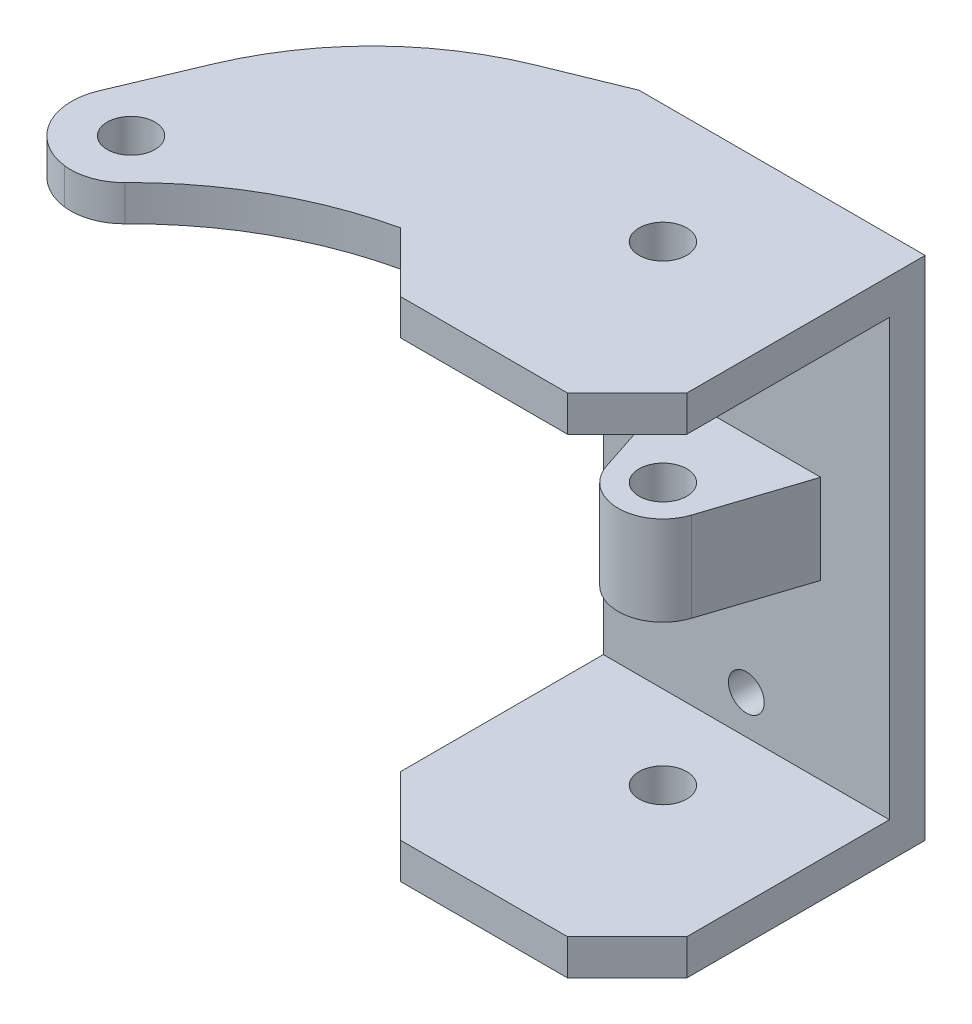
ISO-10303-21;
HEADER;
FILE_DESCRIPTION(('STEP AP214'),'2;1');
FILE_NAME('part.step','',(''),(''),'','','');
FILE_SCHEMA(('AUTOMOTIVE_DESIGN { 1 0 10303 214 1 1 1 1 }'));
ENDSEC;
DATA;
#1=APPLICATION_CONTEXT('core data for automotive mechanical design processes');
#2=APPLICATION_PROTOCOL_DEFINITION('international standard','automotive_design',2000,#1);
#3=PRODUCT_CONTEXT('',#1,'mechanical');
#4=PRODUCT('Part','Part','',(#3));
#5=PRODUCT_RELATED_PRODUCT_CATEGORY('part','',(#4));
#6=PRODUCT_DEFINITION_FORMATION('','',#4);
#7=PRODUCT_DEFINITION_CONTEXT('part definition',#1,'design');
#8=PRODUCT_DEFINITION('design','',#6,#7);
#9=PRODUCT_DEFINITION_SHAPE('','',#8);
#10=(LENGTH_UNIT() NAMED_UNIT(*) SI_UNIT(.MILLI.,.METRE.));
#11=(NAMED_UNIT(*) PLANE_ANGLE_UNIT() SI_UNIT($,.RADIAN.));
#12=(NAMED_UNIT(*) SI_UNIT($,.STERADIAN.) SOLID_ANGLE_UNIT());
#13=UNCERTAINTY_MEASURE_WITH_UNIT(LENGTH_MEASURE(1.E-05),#10,'distance_accuracy_value','');
#14=(GEOMETRIC_REPRESENTATION_CONTEXT(3) GLOBAL_UNCERTAINTY_ASSIGNED_CONTEXT((#13)) GLOBAL_UNIT_ASSIGNED_CONTEXT((#10,
#11,#12)) REPRESENTATION_CONTEXT('',''));
#15=CARTESIAN_POINT('',(0.,0.,0.));
#16=DIRECTION('',(0.,0.,1.));
#17=DIRECTION('',(1.,0.,0.));
#18=AXIS2_PLACEMENT_3D('',#15,#16,#17);
#19=CARTESIAN_POINT('',(0.,0.,6.));
#20=DIRECTION('',(0.,0.,-1.));
#21=DIRECTION('',(-1.,0.,0.));
#22=AXIS2_PLACEMENT_3D('',#19,#20,#21);
#23=PLANE('',#22);
#24=DIRECTION('',(0.,-1.,0.));
#25=VECTOR('',#24,1.);
#26=CARTESIAN_POINT('',(-12.4651492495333,0.,6.));
#27=LINE('',#26,#25);
#28=CARTESIAN_POINT('',(-12.4651492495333,7.5,6.));
#29=VERTEX_POINT('',#28);
#30=CARTESIAN_POINT('',(-12.4651492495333,-7.5,6.));
#31=VERTEX_POINT('',#30);
#32=EDGE_CURVE('E310',#29,#31,#27,.T.);
#33=ORIENTED_EDGE('',*,*,#32,.F.);
#34=DIRECTION('',(1.,0.,0.));
#35=VECTOR('',#34,1.);
#36=CARTESIAN_POINT('',(0.,7.5,6.));
#37=LINE('',#36,#35);
#38=CARTESIAN_POINT('',(12.4651492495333,7.5,6.));
#39=VERTEX_POINT('',#38);
#40=EDGE_CURVE('E306',#29,#39,#37,.T.);
#41=ORIENTED_EDGE('',*,*,#40,.T.);
#42=DIRECTION('',(0.,-1.,0.));
#43=VECTOR('',#42,1.);
#44=CARTESIAN_POINT('',(12.4651492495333,0.,6.));
#45=LINE('',#44,#43);
#46=CARTESIAN_POINT('',(12.4651492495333,-7.5,6.));
#47=VERTEX_POINT('',#46);
#48=EDGE_CURVE('E308',#39,#47,#45,.T.);
#49=ORIENTED_EDGE('',*,*,#48,.T.);
#50=DIRECTION('',(1.,0.,0.));
#51=VECTOR('',#50,1.);
#52=CARTESIAN_POINT('',(0.,-7.5,6.));
#53=LINE('',#52,#51);
#54=EDGE_CURVE('E303',#31,#47,#53,.T.);
#55=ORIENTED_EDGE('',*,*,#54,.F.);
#56=EDGE_LOOP('',(#33,#41,#49,#55));
#57=FACE_BOUND('',#56,.T.);
#58=CARTESIAN_POINT('',(0.,30.,6.));
#59=DIRECTION('',(0.,0.,1.));
#60=DIRECTION('',(1.,0.,0.));
#61=AXIS2_PLACEMENT_3D('',#58,#59,#60);
#62=CIRCLE('',#61,3.);
#63=CARTESIAN_POINT('',(3.,30.,6.));
#64=VERTEX_POINT('',#63);
#65=EDGE_CURVE('E340',#64,#64,#62,.T.);
#66=ORIENTED_EDGE('',*,*,#65,.F.);
#67=EDGE_LOOP('',(#66));
#68=FACE_BOUND('',#67,.T.);
#69=CARTESIAN_POINT('',(0.,-30.,6.));
#70=DIRECTION('',(0.,0.,1.));
#71=DIRECTION('',(1.,0.,0.));
#72=AXIS2_PLACEMENT_3D('',#69,#70,#71);
#73=CIRCLE('',#72,3.);
#74=CARTESIAN_POINT('',(3.,-30.,6.));
#75=VERTEX_POINT('',#74);
#76=EDGE_CURVE('E335',#75,#75,#73,.T.);
#77=ORIENTED_EDGE('',*,*,#76,.F.);
#78=EDGE_LOOP('',(#77));
#79=FACE_BOUND('',#78,.T.);
#80=DIRECTION('',(-1.,0.,0.));
#81=VECTOR('',#80,1.);
#82=CARTESIAN_POINT('',(-24.,-36.5,6.));
#83=LINE('',#82,#81);
#84=CARTESIAN_POINT('',(24.,-36.5,6.));
#85=VERTEX_POINT('',#84);
#86=CARTESIAN_POINT('',(-24.,-36.5,6.));
#87=VERTEX_POINT('',#86);
#88=EDGE_CURVE('E313',#85,#87,#83,.T.);
#89=ORIENTED_EDGE('',*,*,#88,.F.);
#90=DIRECTION('',(0.,1.,0.));
#91=VECTOR('',#90,1.);
#92=CARTESIAN_POINT('',(24.,42.5,6.));
#93=LINE('',#92,#91);
#94=CARTESIAN_POINT('',(24.,36.5,6.));
#95=VERTEX_POINT('',#94);
#96=EDGE_CURVE('E351',#85,#95,#93,.T.);
#97=ORIENTED_EDGE('',*,*,#96,.T.);
#98=DIRECTION('',(1.,0.,0.));
#99=VECTOR('',#98,1.);
#100=CARTESIAN_POINT('',(-24.,36.5,6.));
#101=LINE('',#100,#99);
#102=CARTESIAN_POINT('',(-24.,36.5,6.));
#103=VERTEX_POINT('',#102);
#104=EDGE_CURVE('E326',#103,#95,#101,.T.);
#105=ORIENTED_EDGE('',*,*,#104,.F.);
#106=DIRECTION('',(0.,-1.,0.));
#107=VECTOR('',#106,1.);
#108=CARTESIAN_POINT('',(-24.,-42.5,6.));
#109=LINE('',#108,#107);
#110=EDGE_CURVE('E348',#103,#87,#109,.T.);
#111=ORIENTED_EDGE('',*,*,#110,.T.);
#112=EDGE_LOOP('',(#89,#97,#105,#111));
#113=FACE_BOUND('',#112,.T.);
#114=ADVANCED_FACE('F40',(#57,#68,#79,#113),#23,.F.);
#115=CARTESIAN_POINT('',(-24.,-42.5,6.));
#116=DIRECTION('',(1.,0.,0.));
#117=DIRECTION('',(0.,0.,-1.));
#118=AXIS2_PLACEMENT_3D('',#115,#116,#117);
#119=PLANE('',#118);
#120=ORIENTED_EDGE('',*,*,#110,.F.);
#121=DIRECTION('',(0.,0.,-1.));
#122=VECTOR('',#121,1.);
#123=CARTESIAN_POINT('',(-24.,36.5,40.));
#124=LINE('',#123,#122);
#125=CARTESIAN_POINT('',(-24.,36.5,0.));
#126=VERTEX_POINT('',#125);
#127=EDGE_CURVE('E231',#103,#126,#124,.T.);
#128=ORIENTED_EDGE('',*,*,#127,.T.);
#129=DIRECTION('',(0.,-1.,0.));
#130=VECTOR('',#129,1.);
#131=CARTESIAN_POINT('',(-24.,-42.5,0.));
#132=LINE('',#131,#130);
#133=CARTESIAN_POINT('',(-24.,-42.5,0.));
#134=VERTEX_POINT('',#133);
#135=EDGE_CURVE('E339',#126,#134,#132,.T.);
#136=ORIENTED_EDGE('',*,*,#135,.T.);
#137=DIRECTION('',(0.,0.,-1.));
#138=VECTOR('',#137,1.);
#139=CARTESIAN_POINT('',(-24.,-42.5,6.));
#140=LINE('',#139,#138);
#141=CARTESIAN_POINT('',(-24.,-42.5,40.));
#142=VERTEX_POINT('',#141);
#143=EDGE_CURVE('E370',#142,#134,#140,.T.);
#144=ORIENTED_EDGE('',*,*,#143,.F.);
#145=DIRECTION('',(0.,1.,0.));
#146=VECTOR('',#145,1.);
#147=CARTESIAN_POINT('',(-24.,-42.5,40.));
#148=LINE('',#147,#146);
#149=CARTESIAN_POINT('',(-24.,-36.5,40.));
#150=VERTEX_POINT('',#149);
#151=EDGE_CURVE('E202',#142,#150,#148,.T.);
#152=ORIENTED_EDGE('',*,*,#151,.T.);
#153=DIRECTION('',(0.,0.,-1.));
#154=VECTOR('',#153,1.);
#155=CARTESIAN_POINT('',(-24.,-36.5,50.));
#156=LINE('',#155,#154);
#157=EDGE_CURVE('E320',#150,#87,#156,.T.);
#158=ORIENTED_EDGE('',*,*,#157,.T.);
#159=EDGE_LOOP('',(#120,#128,#136,#144,#152,#158));
#160=FACE_BOUND('',#159,.T.);
#161=ADVANCED_FACE('F437',(#160),#119,.F.);
#162=CARTESIAN_POINT('',(-24.,-42.5,6.));
#163=DIRECTION('',(0.,1.,0.));
#164=DIRECTION('',(-1.,0.,0.));
#165=AXIS2_PLACEMENT_3D('',#162,#163,#164);
#166=PLANE('',#165);
#167=CARTESIAN_POINT('',(0.,-42.5,20.));
#168=DIRECTION('',(0.,1.,0.));
#169=DIRECTION('',(-1.,0.,0.));
#170=AXIS2_PLACEMENT_3D('',#167,#168,#169);
#171=CIRCLE('',#170,4.00000000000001);
#172=CARTESIAN_POINT('',(-4.00000000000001,-42.5,20.));
#173=VERTEX_POINT('',#172);
#174=EDGE_CURVE('E268',#173,#173,#171,.T.);
#175=ORIENTED_EDGE('',*,*,#174,.T.);
#176=EDGE_LOOP('',(#175));
#177=FACE_BOUND('',#176,.T.);
#178=DIRECTION('',(1.,0.,0.));
#179=VECTOR('',#178,1.);
#180=CARTESIAN_POINT('',(-24.,-42.5,50.));
#181=LINE('',#180,#179);
#182=CARTESIAN_POINT('',(-14.,-42.5,50.));
#183=VERTEX_POINT('',#182);
#184=CARTESIAN_POINT('',(14.,-42.5,50.));
#185=VERTEX_POINT('',#184);
#186=EDGE_CURVE('E314',#183,#185,#181,.T.);
#187=ORIENTED_EDGE('',*,*,#186,.F.);
#188=DIRECTION('',(0.707106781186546,0.,0.707106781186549));
#189=VECTOR('',#188,1.);
#190=CARTESIAN_POINT('',(-14.,-42.5,50.));
#191=LINE('',#190,#189);
#192=EDGE_CURVE('E225',#183,#142,#191,.F.);
#193=ORIENTED_EDGE('',*,*,#192,.T.);
#194=ORIENTED_EDGE('',*,*,#143,.T.);
#195=DIRECTION('',(1.,0.,0.));
#196=VECTOR('',#195,1.);
#197=CARTESIAN_POINT('',(-24.,-42.5,0.));
#198=LINE('',#197,#196);
#199=CARTESIAN_POINT('',(24.,-42.5,0.));
#200=VERTEX_POINT('',#199);
#201=EDGE_CURVE('E359',#134,#200,#198,.T.);
#202=ORIENTED_EDGE('',*,*,#201,.T.);
#203=DIRECTION('',(0.,0.,-1.));
#204=VECTOR('',#203,1.);
#205=CARTESIAN_POINT('',(24.,-42.5,6.));
#206=LINE('',#205,#204);
#207=CARTESIAN_POINT('',(24.,-42.5,39.9999999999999));
#208=VERTEX_POINT('',#207);
#209=EDGE_CURVE('E368',#208,#200,#206,.T.);
#210=ORIENTED_EDGE('',*,*,#209,.F.);
#211=DIRECTION('',(0.707106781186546,0.,-0.707106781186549));
#212=VECTOR('',#211,1.);
#213=CARTESIAN_POINT('',(14.,-42.5,50.));
#214=LINE('',#213,#212);
#215=EDGE_CURVE('E223',#208,#185,#214,.F.);
#216=ORIENTED_EDGE('',*,*,#215,.T.);
#217=EDGE_LOOP('',(#187,#193,#194,#202,#210,#216));
#218=FACE_BOUND('',#217,.T.);
#219=ADVANCED_FACE('F434',(#177,#218),#166,.F.);
#220=CARTESIAN_POINT('',(24.,42.5,6.));
#221=DIRECTION('',(-1.,0.,0.));
#222=DIRECTION('',(0.,-1.,0.));
#223=AXIS2_PLACEMENT_3D('',#220,#221,#222);
#224=PLANE('',#223);
#225=DIRECTION('',(0.,0.,-1.));
#226=VECTOR('',#225,1.);
#227=CARTESIAN_POINT('',(24.,42.5,6.));
#228=LINE('',#227,#226);
#229=CARTESIAN_POINT('',(24.,42.5,40.));
#230=VERTEX_POINT('',#229);
#231=CARTESIAN_POINT('',(24.,42.5,0.));
#232=VERTEX_POINT('',#231);
#233=EDGE_CURVE('E355',#230,#232,#228,.T.);
#234=ORIENTED_EDGE('',*,*,#233,.F.);
#235=DIRECTION('',(0.,-1.,0.));
#236=VECTOR('',#235,1.);
#237=CARTESIAN_POINT('',(24.,36.5,40.));
#238=LINE('',#237,#236);
#239=CARTESIAN_POINT('',(24.,36.5,40.));
#240=VERTEX_POINT('',#239);
#241=EDGE_CURVE('E215',#230,#240,#238,.T.);
#242=ORIENTED_EDGE('',*,*,#241,.T.);
#243=DIRECTION('',(0.,0.,-1.));
#244=VECTOR('',#243,1.);
#245=CARTESIAN_POINT('',(24.,36.5,50.));
#246=LINE('',#245,#244);
#247=EDGE_CURVE('E331',#240,#95,#246,.T.);
#248=ORIENTED_EDGE('',*,*,#247,.T.);
#249=ORIENTED_EDGE('',*,*,#96,.F.);
#250=DIRECTION('',(0.,0.,-1.));
#251=VECTOR('',#250,1.);
#252=CARTESIAN_POINT('',(24.,-36.5,50.));
#253=LINE('',#252,#251);
#254=CARTESIAN_POINT('',(24.,-36.5,39.9999999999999));
#255=VERTEX_POINT('',#254);
#256=EDGE_CURVE('E324',#255,#85,#253,.T.);
#257=ORIENTED_EDGE('',*,*,#256,.F.);
#258=DIRECTION('',(0.,-1.,0.));
#259=VECTOR('',#258,1.);
#260=CARTESIAN_POINT('',(24.,42.5,39.9999999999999));
#261=LINE('',#260,#259);
#262=EDGE_CURVE('E213',#255,#208,#261,.T.);
#263=ORIENTED_EDGE('',*,*,#262,.T.);
#264=ORIENTED_EDGE('',*,*,#209,.T.);
#265=DIRECTION('',(0.,1.,0.));
#266=VECTOR('',#265,1.);
#267=CARTESIAN_POINT('',(24.,42.5,0.));
#268=LINE('',#267,#266);
#269=EDGE_CURVE('E362',#200,#232,#268,.T.);
#270=ORIENTED_EDGE('',*,*,#269,.T.);
#271=EDGE_LOOP('',(#234,#242,#248,#249,#257,#263,#264,#270));
#272=FACE_BOUND('',#271,.T.);
#273=ADVANCED_FACE('F389',(#272),#224,.F.);
#274=CARTESIAN_POINT('',(-24.,42.5,6.));
#275=DIRECTION('',(0.,-1.,0.));
#276=DIRECTION('',(0.,0.,-1.));
#277=AXIS2_PLACEMENT_3D('',#274,#275,#276);
#278=PLANE('',#277);
#279=CARTESIAN_POINT('',(0.,42.5,20.));
#280=DIRECTION('',(0.,-1.,0.));
#281=DIRECTION('',(0.,0.,-1.));
#282=AXIS2_PLACEMENT_3D('',#279,#280,#281);
#283=CIRCLE('',#282,4.00000000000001);
#284=CARTESIAN_POINT('',(0.,42.5,16.));
#285=VERTEX_POINT('',#284);
#286=EDGE_CURVE('E280',#285,#285,#283,.T.);
#287=ORIENTED_EDGE('',*,*,#286,.T.);
#288=EDGE_LOOP('',(#287));
#289=FACE_BOUND('',#288,.T.);
#290=CARTESIAN_POINT('',(-60.0021570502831,42.5,49.2388496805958));
#291=DIRECTION('',(0.,1.,0.));
#292=DIRECTION('',(0.,0.,-1.));
#293=AXIS2_PLACEMENT_3D('',#290,#291,#292);
#294=CIRCLE('',#293,10.);
#295=CARTESIAN_POINT('',(-69.2176551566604,42.5,45.356248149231));
#296=VERTEX_POINT('',#295);
#297=CARTESIAN_POINT('',(-61.2698092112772,42.5,59.1581771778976));
#298=VERTEX_POINT('',#297);
#299=EDGE_CURVE('E191',#296,#298,#294,.T.);
#300=ORIENTED_EDGE('',*,*,#299,.T.);
#301=CARTESIAN_POINT('',(-60.1289222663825,42.5,50.230782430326));
#302=DIRECTION('',(0.,-1.,0.));
#303=DIRECTION('',(0.,0.,-1.));
#304=AXIS2_PLACEMENT_3D('',#301,#302,#303);
#305=CIRCLE('',#304,9.);
#306=CARTESIAN_POINT('',(-53.7034653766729,42.5,56.5326475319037));
#307=VERTEX_POINT('',#306);
#308=EDGE_CURVE('E62',#298,#307,#305,.F.);
#309=ORIENTED_EDGE('',*,*,#308,.T.);
#310=CARTESIAN_POINT('',(-10.8670861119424,42.5,98.5450815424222));
#311=DIRECTION('',(0.,-1.,0.));
#312=DIRECTION('',(0.,0.,1.));
#313=AXIS2_PLACEMENT_3D('',#310,#311,#312);
#314=CIRCLE('',#313,60.);
#315=CARTESIAN_POINT('',(-24.,42.5,40.));
#316=VERTEX_POINT('',#315);
#317=EDGE_CURVE('E400',#307,#316,#314,.T.);
#318=ORIENTED_EDGE('',*,*,#317,.T.);
#319=DIRECTION('',(0.707106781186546,0.,0.707106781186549));
#320=VECTOR('',#319,1.);
#321=CARTESIAN_POINT('',(-14.,42.5,50.));
#322=LINE('',#321,#320);
#323=CARTESIAN_POINT('',(-14.,42.5,50.));
#324=VERTEX_POINT('',#323);
#325=EDGE_CURVE('E206',#316,#324,#322,.T.);
#326=ORIENTED_EDGE('',*,*,#325,.T.);
#327=DIRECTION('',(-1.,0.,0.));
#328=VECTOR('',#327,1.);
#329=CARTESIAN_POINT('',(-24.,42.5,50.));
#330=LINE('',#329,#328);
#331=CARTESIAN_POINT('',(14.,42.5,50.));
#332=VERTEX_POINT('',#331);
#333=EDGE_CURVE('E328',#332,#324,#330,.T.);
#334=ORIENTED_EDGE('',*,*,#333,.F.);
#335=DIRECTION('',(0.707106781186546,0.,-0.707106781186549));
#336=VECTOR('',#335,1.);
#337=CARTESIAN_POINT('',(14.,42.5,50.));
#338=LINE('',#337,#336);
#339=EDGE_CURVE('E207',#332,#230,#338,.T.);
#340=ORIENTED_EDGE('',*,*,#339,.T.);
#341=ORIENTED_EDGE('',*,*,#233,.T.);
#342=DIRECTION('',(-1.,0.,0.));
#343=VECTOR('',#342,1.);
#344=CARTESIAN_POINT('',(-24.,42.5,0.));
#345=LINE('',#344,#343);
#346=CARTESIAN_POINT('',(-24.,42.5,0.));
#347=VERTEX_POINT('',#346);
#348=EDGE_CURVE('E352',#232,#347,#345,.T.);
#349=ORIENTED_EDGE('',*,*,#348,.T.);
#350=DIRECTION('',(-0.926175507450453,0.,0.37709273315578));
#351=VECTOR('',#350,1.);
#352=CARTESIAN_POINT('',(-24.,42.5,0.));
#353=LINE('',#352,#351);
#354=CARTESIAN_POINT('',(-36.3326948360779,42.5,5.02126169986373));
#355=VERTEX_POINT('',#354);
#356=EDGE_CURVE('E259',#347,#355,#353,.T.);
#357=ORIENTED_EDGE('',*,*,#356,.T.);
#358=CARTESIAN_POINT('',(-17.4780581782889,42.5,51.3300370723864));
#359=DIRECTION('',(0.,-1.,0.));
#360=DIRECTION('',(0.,0.,-1.));
#361=AXIS2_PLACEMENT_3D('',#358,#359,#360);
#362=CIRCLE('',#361,50.);
#363=CARTESIAN_POINT('',(-63.5555487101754,42.5,31.9170294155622));
#364=VERTEX_POINT('',#363);
#365=EDGE_CURVE('E235',#355,#364,#362,.F.);
#366=ORIENTED_EDGE('',*,*,#365,.T.);
#367=DIRECTION('',(-0.388260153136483,0.,0.921549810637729));
#368=VECTOR('',#367,1.);
#369=CARTESIAN_POINT('',(-55.5144176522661,42.5,12.8311079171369));
#370=LINE('',#369,#368);
#371=EDGE_CURVE('E256',#364,#296,#370,.T.);
#372=ORIENTED_EDGE('',*,*,#371,.T.);
#373=EDGE_LOOP('',(#300,#309,#318,#326,#334,#340,#341,#349,#357,#366,#372));
#374=FACE_BOUND('',#373,.T.);
#375=CARTESIAN_POINT('',(-60.0021570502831,42.5,49.2388496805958));
#376=DIRECTION('',(0.,1.,0.));
#377=DIRECTION('',(0.,0.,1.));
#378=AXIS2_PLACEMENT_3D('',#375,#376,#377);
#379=CIRCLE('',#378,4.);
#380=CARTESIAN_POINT('',(-60.0021570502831,42.5,53.2388496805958));
#381=VERTEX_POINT('',#380);
#382=EDGE_CURVE('E411',#381,#381,#379,.T.);
#383=ORIENTED_EDGE('',*,*,#382,.F.);
#384=EDGE_LOOP('',(#383));
#385=FACE_BOUND('',#384,.T.);
#386=ADVANCED_FACE('F253',(#289,#374,#385),#278,.F.);
#387=CARTESIAN_POINT('',(0.,0.,0.));
#388=DIRECTION('',(0.,0.,-1.));
#389=DIRECTION('',(-1.,0.,0.));
#390=AXIS2_PLACEMENT_3D('',#387,#388,#389);
#391=PLANE('',#390);
#392=CARTESIAN_POINT('',(0.,30.,0.));
#393=DIRECTION('',(0.,0.,1.));
#394=DIRECTION('',(1.,0.,0.));
#395=AXIS2_PLACEMENT_3D('',#392,#393,#394);
#396=CIRCLE('',#395,3.);
#397=CARTESIAN_POINT('',(3.,30.,0.));
#398=VERTEX_POINT('',#397);
#399=EDGE_CURVE('E336',#398,#398,#396,.T.);
#400=ORIENTED_EDGE('',*,*,#399,.T.);
#401=EDGE_LOOP('',(#400));
#402=FACE_BOUND('',#401,.T.);
#403=CARTESIAN_POINT('',(0.,-30.,0.));
#404=DIRECTION('',(0.,0.,1.));
#405=DIRECTION('',(1.,0.,0.));
#406=AXIS2_PLACEMENT_3D('',#403,#404,#405);
#407=CIRCLE('',#406,3.);
#408=CARTESIAN_POINT('',(3.,-30.,0.));
#409=VERTEX_POINT('',#408);
#410=EDGE_CURVE('E343',#409,#409,#407,.T.);
#411=ORIENTED_EDGE('',*,*,#410,.T.);
#412=EDGE_LOOP('',(#411));
#413=FACE_BOUND('',#412,.T.);
#414=EDGE_CURVE('E356',#347,#126,#132,.T.);
#415=ORIENTED_EDGE('',*,*,#414,.F.);
#416=ORIENTED_EDGE('',*,*,#348,.F.);
#417=ORIENTED_EDGE('',*,*,#269,.F.);
#418=ORIENTED_EDGE('',*,*,#201,.F.);
#419=ORIENTED_EDGE('',*,*,#135,.F.);
#420=EDGE_LOOP('',(#415,#416,#417,#418,#419));
#421=FACE_BOUND('',#420,.T.);
#422=ADVANCED_FACE('F396',(#402,#413,#421),#391,.T.);
#423=CARTESIAN_POINT('',(0.,-30.,0.));
#424=DIRECTION('',(0.,0.,1.));
#425=DIRECTION('',(1.,0.,0.));
#426=AXIS2_PLACEMENT_3D('',#423,#424,#425);
#427=CYLINDRICAL_SURFACE('',#426,3.);
#428=ORIENTED_EDGE('',*,*,#410,.F.);
#429=EDGE_LOOP('',(#428));
#430=FACE_BOUND('',#429,.T.);
#431=ORIENTED_EDGE('',*,*,#76,.T.);
#432=EDGE_LOOP('',(#431));
#433=FACE_BOUND('',#432,.T.);
#434=ADVANCED_FACE('F431',(#430,#433),#427,.F.);
#435=CARTESIAN_POINT('',(0.,30.,0.));
#436=DIRECTION('',(0.,0.,1.));
#437=DIRECTION('',(1.,0.,0.));
#438=AXIS2_PLACEMENT_3D('',#435,#436,#437);
#439=CYLINDRICAL_SURFACE('',#438,3.);
#440=ORIENTED_EDGE('',*,*,#399,.F.);
#441=EDGE_LOOP('',(#440));
#442=FACE_BOUND('',#441,.T.);
#443=ORIENTED_EDGE('',*,*,#65,.T.);
#444=EDGE_LOOP('',(#443));
#445=FACE_BOUND('',#444,.T.);
#446=ADVANCED_FACE('F449',(#442,#445),#439,.F.);
#447=CARTESIAN_POINT('',(-24.,36.5,50.));
#448=DIRECTION('',(0.,1.,0.));
#449=DIRECTION('',(0.,0.,1.));
#450=AXIS2_PLACEMENT_3D('',#447,#448,#449);
#451=PLANE('',#450);
#452=CARTESIAN_POINT('',(0.,36.5,20.));
#453=DIRECTION('',(0.,1.,0.));
#454=DIRECTION('',(0.,0.,1.));
#455=AXIS2_PLACEMENT_3D('',#452,#453,#454);
#456=CIRCLE('',#455,4.00000000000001);
#457=CARTESIAN_POINT('',(0.,36.5,24.));
#458=VERTEX_POINT('',#457);
#459=EDGE_CURVE('E277',#458,#458,#456,.T.);
#460=ORIENTED_EDGE('',*,*,#459,.T.);
#461=EDGE_LOOP('',(#460));
#462=FACE_BOUND('',#461,.T.);
#463=CARTESIAN_POINT('',(-10.8670861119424,36.5,98.5450815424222));
#464=DIRECTION('',(0.,-1.,0.));
#465=DIRECTION('',(0.,0.,1.));
#466=AXIS2_PLACEMENT_3D('',#463,#464,#465);
#467=CIRCLE('',#466,60.);
#468=CARTESIAN_POINT('',(-53.7034653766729,36.5,56.5326475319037));
#469=VERTEX_POINT('',#468);
#470=CARTESIAN_POINT('',(-24.,36.5,40.));
#471=VERTEX_POINT('',#470);
#472=EDGE_CURVE('E182',#469,#471,#467,.T.);
#473=ORIENTED_EDGE('',*,*,#472,.F.);
#474=CARTESIAN_POINT('',(-60.1289222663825,36.5,50.230782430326));
#475=DIRECTION('',(0.,1.,0.));
#476=DIRECTION('',(0.,0.,1.));
#477=AXIS2_PLACEMENT_3D('',#474,#475,#476);
#478=CIRCLE('',#477,9.);
#479=CARTESIAN_POINT('',(-61.2698092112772,36.5,59.1581771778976));
#480=VERTEX_POINT('',#479);
#481=EDGE_CURVE('E11',#469,#480,#478,.F.);
#482=ORIENTED_EDGE('',*,*,#481,.T.);
#483=CARTESIAN_POINT('',(-60.0021570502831,36.5,49.2388496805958));
#484=DIRECTION('',(0.,1.,0.));
#485=DIRECTION('',(0.,0.,-1.));
#486=AXIS2_PLACEMENT_3D('',#483,#484,#485);
#487=CIRCLE('',#486,10.);
#488=CARTESIAN_POINT('',(-69.2176551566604,36.5,45.356248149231));
#489=VERTEX_POINT('',#488);
#490=EDGE_CURVE('E251',#489,#480,#487,.T.);
#491=ORIENTED_EDGE('',*,*,#490,.F.);
#492=DIRECTION('',(-0.388260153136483,0.,0.921549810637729));
#493=VECTOR('',#492,1.);
#494=CARTESIAN_POINT('',(-55.5144176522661,36.5,12.8311079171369));
#495=LINE('',#494,#493);
#496=CARTESIAN_POINT('',(-63.5555487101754,36.5,31.9170294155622));
#497=VERTEX_POINT('',#496);
#498=EDGE_CURVE('E405',#497,#489,#495,.T.);
#499=ORIENTED_EDGE('',*,*,#498,.F.);
#500=CARTESIAN_POINT('',(-17.4780581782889,36.5,51.3300370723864));
#501=DIRECTION('',(0.,1.,0.));
#502=DIRECTION('',(0.,0.,1.));
#503=AXIS2_PLACEMENT_3D('',#500,#501,#502);
#504=CIRCLE('',#503,50.);
#505=CARTESIAN_POINT('',(-36.3326948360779,36.5,5.02126169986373));
#506=VERTEX_POINT('',#505);
#507=EDGE_CURVE('E239',#497,#506,#504,.F.);
#508=ORIENTED_EDGE('',*,*,#507,.T.);
#509=DIRECTION('',(-0.926175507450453,0.,0.37709273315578));
#510=VECTOR('',#509,1.);
#511=CARTESIAN_POINT('',(-24.,36.5,0.));
#512=LINE('',#511,#510);
#513=EDGE_CURVE('E190',#126,#506,#512,.T.);
#514=ORIENTED_EDGE('',*,*,#513,.F.);
#515=ORIENTED_EDGE('',*,*,#127,.F.);
#516=ORIENTED_EDGE('',*,*,#104,.T.);
#517=ORIENTED_EDGE('',*,*,#247,.F.);
#518=DIRECTION('',(-0.707106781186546,0.,0.707106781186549));
#519=VECTOR('',#518,1.);
#520=CARTESIAN_POINT('',(14.,36.5,50.));
#521=LINE('',#520,#519);
#522=CARTESIAN_POINT('',(14.,36.5,50.));
#523=VERTEX_POINT('',#522);
#524=EDGE_CURVE('E203',#240,#523,#521,.T.);
#525=ORIENTED_EDGE('',*,*,#524,.T.);
#526=DIRECTION('',(1.,0.,0.));
#527=VECTOR('',#526,1.);
#528=CARTESIAN_POINT('',(-24.,36.5,50.));
#529=LINE('',#528,#527);
#530=CARTESIAN_POINT('',(-14.,36.5,50.));
#531=VERTEX_POINT('',#530);
#532=EDGE_CURVE('E198',#531,#523,#529,.T.);
#533=ORIENTED_EDGE('',*,*,#532,.F.);
#534=DIRECTION('',(-0.707106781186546,0.,-0.707106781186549));
#535=VECTOR('',#534,1.);
#536=CARTESIAN_POINT('',(-14.,36.5,50.));
#537=LINE('',#536,#535);
#538=EDGE_CURVE('E194',#531,#471,#537,.T.);
#539=ORIENTED_EDGE('',*,*,#538,.T.);
#540=EDGE_LOOP('',(#473,#482,#491,#499,#508,#514,#515,#516,#517,#525,#533,#539));
#541=FACE_BOUND('',#540,.T.);
#542=CARTESIAN_POINT('',(-60.0021570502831,36.5,49.2388496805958));
#543=DIRECTION('',(0.,1.,0.));
#544=DIRECTION('',(0.,0.,1.));
#545=AXIS2_PLACEMENT_3D('',#542,#543,#544);
#546=CIRCLE('',#545,4.);
#547=CARTESIAN_POINT('',(-60.0021570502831,36.5,53.2388496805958));
#548=VERTEX_POINT('',#547);
#549=EDGE_CURVE('E401',#548,#548,#546,.T.);
#550=ORIENTED_EDGE('',*,*,#549,.T.);
#551=EDGE_LOOP('',(#550));
#552=FACE_BOUND('',#551,.T.);
#553=ADVANCED_FACE('F195',(#462,#541,#552),#451,.F.);
#554=CARTESIAN_POINT('',(0.,0.,50.));
#555=DIRECTION('',(0.,0.,1.));
#556=DIRECTION('',(1.,0.,0.));
#557=AXIS2_PLACEMENT_3D('',#554,#555,#556);
#558=PLANE('',#557);
#559=ORIENTED_EDGE('',*,*,#333,.T.);
#560=DIRECTION('',(0.,-1.,0.));
#561=VECTOR('',#560,1.);
#562=CARTESIAN_POINT('',(-14.,36.5,50.));
#563=LINE('',#562,#561);
#564=EDGE_CURVE('E376',#324,#531,#563,.T.);
#565=ORIENTED_EDGE('',*,*,#564,.T.);
#566=ORIENTED_EDGE('',*,*,#532,.T.);
#567=DIRECTION('',(0.,1.,0.));
#568=VECTOR('',#567,1.);
#569=CARTESIAN_POINT('',(14.,42.5,50.));
#570=LINE('',#569,#568);
#571=EDGE_CURVE('E373',#523,#332,#570,.T.);
#572=ORIENTED_EDGE('',*,*,#571,.T.);
#573=EDGE_LOOP('',(#559,#565,#566,#572));
#574=FACE_BOUND('',#573,.T.);
#575=ADVANCED_FACE('F384',(#574),#558,.T.);
#576=CARTESIAN_POINT('',(-24.,-36.5,50.));
#577=DIRECTION('',(0.,-1.,0.));
#578=DIRECTION('',(0.,0.,-1.));
#579=AXIS2_PLACEMENT_3D('',#576,#577,#578);
#580=PLANE('',#579);
#581=CARTESIAN_POINT('',(0.,-36.5,20.));
#582=DIRECTION('',(0.,-1.,0.));
#583=DIRECTION('',(0.,0.,-1.));
#584=AXIS2_PLACEMENT_3D('',#581,#582,#583);
#585=CIRCLE('',#584,4.00000000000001);
#586=CARTESIAN_POINT('',(0.,-36.5,16.));
#587=VERTEX_POINT('',#586);
#588=EDGE_CURVE('E265',#587,#587,#585,.T.);
#589=ORIENTED_EDGE('',*,*,#588,.T.);
#590=EDGE_LOOP('',(#589));
#591=FACE_BOUND('',#590,.T.);
#592=ORIENTED_EDGE('',*,*,#157,.F.);
#593=DIRECTION('',(-0.707106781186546,0.,-0.707106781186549));
#594=VECTOR('',#593,1.);
#595=CARTESIAN_POINT('',(-14.,-36.5,50.));
#596=LINE('',#595,#594);
#597=CARTESIAN_POINT('',(-14.,-36.5,50.));
#598=VERTEX_POINT('',#597);
#599=EDGE_CURVE('E229',#150,#598,#596,.F.);
#600=ORIENTED_EDGE('',*,*,#599,.T.);
#601=DIRECTION('',(-1.,0.,0.));
#602=VECTOR('',#601,1.);
#603=CARTESIAN_POINT('',(-24.,-36.5,50.));
#604=LINE('',#603,#602);
#605=CARTESIAN_POINT('',(14.,-36.5,50.));
#606=VERTEX_POINT('',#605);
#607=EDGE_CURVE('E317',#606,#598,#604,.T.);
#608=ORIENTED_EDGE('',*,*,#607,.F.);
#609=DIRECTION('',(-0.707106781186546,0.,0.707106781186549));
#610=VECTOR('',#609,1.);
#611=CARTESIAN_POINT('',(14.,-36.5,50.));
#612=LINE('',#611,#610);
#613=EDGE_CURVE('E227',#606,#255,#612,.F.);
#614=ORIENTED_EDGE('',*,*,#613,.T.);
#615=ORIENTED_EDGE('',*,*,#256,.T.);
#616=ORIENTED_EDGE('',*,*,#88,.T.);
#617=EDGE_LOOP('',(#592,#600,#608,#614,#615,#616));
#618=FACE_BOUND('',#617,.T.);
#619=ADVANCED_FACE('F459',(#591,#618),#580,.F.);
#620=CARTESIAN_POINT('',(0.,0.,50.));
#621=DIRECTION('',(0.,0.,-1.));
#622=DIRECTION('',(-1.,0.,0.));
#623=AXIS2_PLACEMENT_3D('',#620,#621,#622);
#624=PLANE('',#623);
#625=ORIENTED_EDGE('',*,*,#607,.T.);
#626=DIRECTION('',(0.,-1.,0.));
#627=VECTOR('',#626,1.);
#628=CARTESIAN_POINT('',(-14.,0.,50.));
#629=LINE('',#628,#627);
#630=EDGE_CURVE('E220',#598,#183,#629,.T.);
#631=ORIENTED_EDGE('',*,*,#630,.T.);
#632=ORIENTED_EDGE('',*,*,#186,.T.);
#633=DIRECTION('',(0.,1.,0.));
#634=VECTOR('',#633,1.);
#635=CARTESIAN_POINT('',(14.,0.,50.));
#636=LINE('',#635,#634);
#637=EDGE_CURVE('E217',#185,#606,#636,.T.);
#638=ORIENTED_EDGE('',*,*,#637,.T.);
#639=EDGE_LOOP('',(#625,#631,#632,#638));
#640=FACE_BOUND('',#639,.T.);
#641=ADVANCED_FACE('F462',(#640),#624,.F.);
#642=CARTESIAN_POINT('',(-14.,0.,50.));
#643=DIRECTION('',(-0.707106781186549,0.,0.707106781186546));
#644=DIRECTION('',(0.,1.,0.));
#645=AXIS2_PLACEMENT_3D('',#642,#643,#644);
#646=PLANE('',#645);
#647=ORIENTED_EDGE('',*,*,#325,.F.);
#648=DIRECTION('',(0.,1.,0.));
#649=VECTOR('',#648,1.);
#650=CARTESIAN_POINT('',(-24.,42.5,40.));
#651=LINE('',#650,#649);
#652=EDGE_CURVE('E186',#471,#316,#651,.T.);
#653=ORIENTED_EDGE('',*,*,#652,.F.);
#654=ORIENTED_EDGE('',*,*,#538,.F.);
#655=ORIENTED_EDGE('',*,*,#564,.F.);
#656=EDGE_LOOP('',(#647,#653,#654,#655));
#657=FACE_BOUND('',#656,.T.);
#658=ADVANCED_FACE('F205',(#657),#646,.T.);
#659=CARTESIAN_POINT('',(14.,0.,50.));
#660=DIRECTION('',(0.707106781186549,0.,0.707106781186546));
#661=DIRECTION('',(0.,-1.,0.));
#662=AXIS2_PLACEMENT_3D('',#659,#660,#661);
#663=PLANE('',#662);
#664=ORIENTED_EDGE('',*,*,#524,.F.);
#665=ORIENTED_EDGE('',*,*,#241,.F.);
#666=ORIENTED_EDGE('',*,*,#339,.F.);
#667=ORIENTED_EDGE('',*,*,#571,.F.);
#668=EDGE_LOOP('',(#664,#665,#666,#667));
#669=FACE_BOUND('',#668,.T.);
#670=ADVANCED_FACE('F386',(#669),#663,.T.);
#671=CARTESIAN_POINT('',(-14.,0.,50.));
#672=DIRECTION('',(0.707106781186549,0.,-0.707106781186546));
#673=DIRECTION('',(0.,-1.,0.));
#674=AXIS2_PLACEMENT_3D('',#671,#672,#673);
#675=PLANE('',#674);
#676=ORIENTED_EDGE('',*,*,#599,.F.);
#677=ORIENTED_EDGE('',*,*,#151,.F.);
#678=ORIENTED_EDGE('',*,*,#192,.F.);
#679=ORIENTED_EDGE('',*,*,#630,.F.);
#680=EDGE_LOOP('',(#676,#677,#678,#679));
#681=FACE_BOUND('',#680,.T.);
#682=ADVANCED_FACE('F620',(#681),#675,.F.);
#683=CARTESIAN_POINT('',(14.,0.,50.));
#684=DIRECTION('',(-0.707106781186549,0.,-0.707106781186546));
#685=DIRECTION('',(0.,1.,0.));
#686=AXIS2_PLACEMENT_3D('',#683,#684,#685);
#687=PLANE('',#686);
#688=ORIENTED_EDGE('',*,*,#215,.F.);
#689=ORIENTED_EDGE('',*,*,#262,.F.);
#690=ORIENTED_EDGE('',*,*,#613,.F.);
#691=ORIENTED_EDGE('',*,*,#637,.F.);
#692=EDGE_LOOP('',(#688,#689,#690,#691));
#693=FACE_BOUND('',#692,.T.);
#694=ADVANCED_FACE('F471',(#693),#687,.F.);
#695=CARTESIAN_POINT('',(-13.0340005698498,7.5,4.25920275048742));
#696=DIRECTION('',(0.950536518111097,0.,-0.310612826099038));
#697=DIRECTION('',(-0.310612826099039,0.,-0.950536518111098));
#698=AXIS2_PLACEMENT_3D('',#695,#696,#697);
#699=PLANE('',#698);
#700=DIRECTION('',(0.310612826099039,0.,0.950536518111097));
#701=VECTOR('',#700,1.);
#702=CARTESIAN_POINT('',(-13.0340005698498,7.5,4.25920275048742));
#703=LINE('',#702,#701);
#704=CARTESIAN_POINT('',(-7.12902388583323,7.5,22.3295961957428));
#705=VERTEX_POINT('',#704);
#706=EDGE_CURVE('E284',#29,#705,#703,.T.);
#707=ORIENTED_EDGE('',*,*,#706,.F.);
#708=ORIENTED_EDGE('',*,*,#32,.T.);
#709=DIRECTION('',(0.310612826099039,0.,0.950536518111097));
#710=VECTOR('',#709,1.);
#711=CARTESIAN_POINT('',(-13.0340005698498,-7.5,4.25920275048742));
#712=LINE('',#711,#710);
#713=CARTESIAN_POINT('',(-7.12902388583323,-7.5,22.3295961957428));
#714=VERTEX_POINT('',#713);
#715=EDGE_CURVE('E283',#31,#714,#712,.T.);
#716=ORIENTED_EDGE('',*,*,#715,.T.);
#717=DIRECTION('',(0.,-1.,0.));
#718=VECTOR('',#717,1.);
#719=CARTESIAN_POINT('',(-7.12902388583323,7.5,22.3295961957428));
#720=LINE('',#719,#718);
#721=EDGE_CURVE('E300',#705,#714,#720,.T.);
#722=ORIENTED_EDGE('',*,*,#721,.F.);
#723=EDGE_LOOP('',(#707,#708,#716,#722));
#724=FACE_BOUND('',#723,.T.);
#725=ADVANCED_FACE('F467',(#724),#699,.F.);
#726=CARTESIAN_POINT('',(13.0340005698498,7.5,4.25920275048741));
#727=DIRECTION('',(0.950536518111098,0.,0.310612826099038));
#728=DIRECTION('',(0.310612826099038,0.,-0.950536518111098));
#729=AXIS2_PLACEMENT_3D('',#726,#727,#728);
#730=PLANE('',#729);
#731=ORIENTED_EDGE('',*,*,#48,.F.);
#732=DIRECTION('',(-0.310612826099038,0.,0.950536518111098));
#733=VECTOR('',#732,1.);
#734=CARTESIAN_POINT('',(13.0340005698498,7.5,4.25920275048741));
#735=LINE('',#734,#733);
#736=CARTESIAN_POINT('',(7.12902388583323,7.5,22.3295961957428));
#737=VERTEX_POINT('',#736);
#738=EDGE_CURVE('E290',#39,#737,#735,.T.);
#739=ORIENTED_EDGE('',*,*,#738,.T.);
#740=DIRECTION('',(0.,-1.,0.));
#741=VECTOR('',#740,1.);
#742=CARTESIAN_POINT('',(7.12902388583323,7.5,22.3295961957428));
#743=LINE('',#742,#741);
#744=CARTESIAN_POINT('',(7.12902388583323,-7.5,22.3295961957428));
#745=VERTEX_POINT('',#744);
#746=EDGE_CURVE('E292',#737,#745,#743,.T.);
#747=ORIENTED_EDGE('',*,*,#746,.T.);
#748=DIRECTION('',(-0.310612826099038,0.,0.950536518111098));
#749=VECTOR('',#748,1.);
#750=CARTESIAN_POINT('',(13.0340005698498,-7.5,4.25920275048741));
#751=LINE('',#750,#749);
#752=EDGE_CURVE('E287',#47,#745,#751,.T.);
#753=ORIENTED_EDGE('',*,*,#752,.F.);
#754=EDGE_LOOP('',(#731,#739,#747,#753));
#755=FACE_BOUND('',#754,.T.);
#756=ADVANCED_FACE('F470',(#755),#730,.T.);
#757=CARTESIAN_POINT('',(0.,7.5,0.));
#758=DIRECTION('',(0.,1.,0.));
#759=DIRECTION('',(0.,0.,1.));
#760=AXIS2_PLACEMENT_3D('',#757,#758,#759);
#761=PLANE('',#760);
#762=CARTESIAN_POINT('',(0.,7.5,20.));
#763=DIRECTION('',(0.,1.,0.));
#764=DIRECTION('',(0.,0.,1.));
#765=AXIS2_PLACEMENT_3D('',#762,#763,#764);
#766=CIRCLE('',#765,4.00000000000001);
#767=CARTESIAN_POINT('',(0.,7.5,24.));
#768=VERTEX_POINT('',#767);
#769=EDGE_CURVE('E274',#768,#768,#766,.T.);
#770=ORIENTED_EDGE('',*,*,#769,.F.);
#771=EDGE_LOOP('',(#770));
#772=FACE_BOUND('',#771,.T.);
#773=ORIENTED_EDGE('',*,*,#40,.F.);
#774=ORIENTED_EDGE('',*,*,#706,.T.);
#775=CARTESIAN_POINT('',(0.,7.5,20.));
#776=DIRECTION('',(0.,1.,0.));
#777=DIRECTION('',(0.,0.,1.));
#778=AXIS2_PLACEMENT_3D('',#775,#776,#777);
#779=CIRCLE('',#778,7.5);
#780=EDGE_CURVE('E286',#705,#737,#779,.T.);
#781=ORIENTED_EDGE('',*,*,#780,.T.);
#782=ORIENTED_EDGE('',*,*,#738,.F.);
#783=EDGE_LOOP('',(#773,#774,#781,#782));
#784=FACE_BOUND('',#783,.T.);
#785=ADVANCED_FACE('F481',(#772,#784),#761,.T.);
#786=CARTESIAN_POINT('',(0.,-7.5,0.));
#787=DIRECTION('',(0.,1.,0.));
#788=DIRECTION('',(0.,0.,1.));
#789=AXIS2_PLACEMENT_3D('',#786,#787,#788);
#790=PLANE('',#789);
#791=CARTESIAN_POINT('',(0.,-7.5,20.));
#792=DIRECTION('',(0.,-1.,0.));
#793=DIRECTION('',(0.,0.,-1.));
#794=AXIS2_PLACEMENT_3D('',#791,#792,#793);
#795=CIRCLE('',#794,4.00000000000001);
#796=CARTESIAN_POINT('',(0.,-7.5,16.));
#797=VERTEX_POINT('',#796);
#798=EDGE_CURVE('E271',#797,#797,#795,.T.);
#799=ORIENTED_EDGE('',*,*,#798,.F.);
#800=EDGE_LOOP('',(#799));
#801=FACE_BOUND('',#800,.T.);
#802=ORIENTED_EDGE('',*,*,#715,.F.);
#803=ORIENTED_EDGE('',*,*,#54,.T.);
#804=ORIENTED_EDGE('',*,*,#752,.T.);
#805=CARTESIAN_POINT('',(0.,-7.5,20.));
#806=DIRECTION('',(0.,1.,0.));
#807=DIRECTION('',(0.,0.,1.));
#808=AXIS2_PLACEMENT_3D('',#805,#806,#807);
#809=CIRCLE('',#808,7.5);
#810=EDGE_CURVE('E294',#714,#745,#809,.T.);
#811=ORIENTED_EDGE('',*,*,#810,.F.);
#812=EDGE_LOOP('',(#802,#803,#804,#811));
#813=FACE_BOUND('',#812,.T.);
#814=ADVANCED_FACE('F477',(#801,#813),#790,.F.);
#815=CARTESIAN_POINT('',(0.,7.5,20.));
#816=DIRECTION('',(0.,-1.,0.));
#817=DIRECTION('',(0.,0.,-1.));
#818=AXIS2_PLACEMENT_3D('',#815,#816,#817);
#819=CYLINDRICAL_SURFACE('',#818,7.5);
#820=ORIENTED_EDGE('',*,*,#810,.T.);
#821=ORIENTED_EDGE('',*,*,#746,.F.);
#822=ORIENTED_EDGE('',*,*,#780,.F.);
#823=ORIENTED_EDGE('',*,*,#721,.T.);
#824=EDGE_LOOP('',(#820,#821,#822,#823));
#825=FACE_BOUND('',#824,.T.);
#826=ADVANCED_FACE('F473',(#825),#819,.T.);
#827=CARTESIAN_POINT('',(0.,-7.5,20.));
#828=DIRECTION('',(0.,-1.,0.));
#829=DIRECTION('',(0.,0.,-1.));
#830=AXIS2_PLACEMENT_3D('',#827,#828,#829);
#831=CYLINDRICAL_SURFACE('',#830,4.00000000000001);
#832=ORIENTED_EDGE('',*,*,#769,.T.);
#833=EDGE_LOOP('',(#832));
#834=FACE_BOUND('',#833,.T.);
#835=ORIENTED_EDGE('',*,*,#798,.T.);
#836=EDGE_LOOP('',(#835));
#837=FACE_BOUND('',#836,.T.);
#838=ADVANCED_FACE('F476',(#834,#837),#831,.F.);
#839=ORIENTED_EDGE('',*,*,#459,.F.);
#840=EDGE_LOOP('',(#839));
#841=FACE_BOUND('',#840,.T.);
#842=ORIENTED_EDGE('',*,*,#286,.F.);
#843=EDGE_LOOP('',(#842));
#844=FACE_BOUND('',#843,.T.);
#845=ADVANCED_FACE('F491',(#841,#844),#831,.F.);
#846=CARTESIAN_POINT('',(0.,-53.5,20.));
#847=DIRECTION('',(0.,1.,0.));
#848=DIRECTION('',(0.,0.,1.));
#849=AXIS2_PLACEMENT_3D('',#846,#847,#848);
#850=CYLINDRICAL_SURFACE('',#849,4.00000000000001);
#851=ORIENTED_EDGE('',*,*,#588,.F.);
#852=EDGE_LOOP('',(#851));
#853=FACE_BOUND('',#852,.T.);
#854=ORIENTED_EDGE('',*,*,#174,.F.);
#855=EDGE_LOOP('',(#854));
#856=FACE_BOUND('',#855,.T.);
#857=ADVANCED_FACE('F493',(#853,#856),#850,.F.);
#858=CARTESIAN_POINT('',(-10.8670861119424,36.5,98.5450815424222));
#859=DIRECTION('',(0.,1.,0.));
#860=DIRECTION('',(0.,0.,1.));
#861=AXIS2_PLACEMENT_3D('',#858,#859,#860);
#862=CYLINDRICAL_SURFACE('',#861,60.);
#863=ORIENTED_EDGE('',*,*,#317,.F.);
#864=DIRECTION('',(0.,1.,0.));
#865=VECTOR('',#864,1.);
#866=CARTESIAN_POINT('',(-53.7034653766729,36.5,56.5326475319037));
#867=LINE('',#866,#865);
#868=EDGE_CURVE('E48',#307,#469,#867,.F.);
#869=ORIENTED_EDGE('',*,*,#868,.T.);
#870=ORIENTED_EDGE('',*,*,#472,.T.);
#871=ORIENTED_EDGE('',*,*,#652,.T.);
#872=EDGE_LOOP('',(#863,#869,#870,#871));
#873=FACE_BOUND('',#872,.T.);
#874=ADVANCED_FACE('F184',(#873),#862,.F.);
#875=CARTESIAN_POINT('',(-60.0021570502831,36.5,49.2388496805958));
#876=DIRECTION('',(0.,1.,0.));
#877=DIRECTION('',(0.,0.,1.));
#878=AXIS2_PLACEMENT_3D('',#875,#876,#877);
#879=CYLINDRICAL_SURFACE('',#878,10.);
#880=ORIENTED_EDGE('',*,*,#490,.T.);
#881=DIRECTION('',(0.,1.,0.));
#882=VECTOR('',#881,1.);
#883=CARTESIAN_POINT('',(-61.2698092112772,36.5,59.1581771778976));
#884=LINE('',#883,#882);
#885=EDGE_CURVE('E241',#480,#298,#884,.T.);
#886=ORIENTED_EDGE('',*,*,#885,.T.);
#887=ORIENTED_EDGE('',*,*,#299,.F.);
#888=DIRECTION('',(0.,1.,0.));
#889=VECTOR('',#888,1.);
#890=CARTESIAN_POINT('',(-69.2176551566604,36.5,45.356248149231));
#891=LINE('',#890,#889);
#892=EDGE_CURVE('E263',#489,#296,#891,.T.);
#893=ORIENTED_EDGE('',*,*,#892,.F.);
#894=EDGE_LOOP('',(#880,#886,#887,#893));
#895=FACE_BOUND('',#894,.T.);
#896=ADVANCED_FACE('F248',(#895),#879,.T.);
#897=CARTESIAN_POINT('',(-55.5144176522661,36.5,12.8311079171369));
#898=DIRECTION('',(-0.921549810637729,0.,-0.388260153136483));
#899=DIRECTION('',(-0.388260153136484,0.,0.921549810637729));
#900=AXIS2_PLACEMENT_3D('',#897,#898,#899);
#901=PLANE('',#900);
#902=ORIENTED_EDGE('',*,*,#371,.F.);
#903=DIRECTION('',(0.,1.,0.));
#904=VECTOR('',#903,1.);
#905=CARTESIAN_POINT('',(-63.5555487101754,36.5,31.9170294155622));
#906=LINE('',#905,#904);
#907=EDGE_CURVE('E237',#364,#497,#906,.F.);
#908=ORIENTED_EDGE('',*,*,#907,.T.);
#909=ORIENTED_EDGE('',*,*,#498,.T.);
#910=ORIENTED_EDGE('',*,*,#892,.T.);
#911=EDGE_LOOP('',(#902,#908,#909,#910));
#912=FACE_BOUND('',#911,.T.);
#913=ADVANCED_FACE('F501',(#912),#901,.T.);
#914=CARTESIAN_POINT('',(-24.,36.5,0.));
#915=DIRECTION('',(-0.37709273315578,0.,-0.926175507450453));
#916=DIRECTION('',(-0.926175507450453,0.,0.37709273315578));
#917=AXIS2_PLACEMENT_3D('',#914,#915,#916);
#918=PLANE('',#917);
#919=ORIENTED_EDGE('',*,*,#513,.T.);
#920=DIRECTION('',(0.,1.,0.));
#921=VECTOR('',#920,1.);
#922=CARTESIAN_POINT('',(-36.3326948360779,36.5,5.02126169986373));
#923=LINE('',#922,#921);
#924=EDGE_CURVE('E232',#506,#355,#923,.T.);
#925=ORIENTED_EDGE('',*,*,#924,.T.);
#926=ORIENTED_EDGE('',*,*,#356,.F.);
#927=ORIENTED_EDGE('',*,*,#414,.T.);
#928=EDGE_LOOP('',(#919,#925,#926,#927));
#929=FACE_BOUND('',#928,.T.);
#930=ADVANCED_FACE('F421',(#929),#918,.T.);
#931=CARTESIAN_POINT('',(-60.0021570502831,36.5,49.2388496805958));
#932=DIRECTION('',(0.,1.,0.));
#933=DIRECTION('',(0.,0.,1.));
#934=AXIS2_PLACEMENT_3D('',#931,#932,#933);
#935=CYLINDRICAL_SURFACE('',#934,4.);
#936=ORIENTED_EDGE('',*,*,#549,.F.);
#937=EDGE_LOOP('',(#936));
#938=FACE_BOUND('',#937,.T.);
#939=ORIENTED_EDGE('',*,*,#382,.T.);
#940=EDGE_LOOP('',(#939));
#941=FACE_BOUND('',#940,.T.);
#942=ADVANCED_FACE('F417',(#938,#941),#935,.F.);
#943=CARTESIAN_POINT('',(-17.4780581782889,36.5,51.3300370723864));
#944=DIRECTION('',(0.,1.,0.));
#945=DIRECTION('',(0.,0.,1.));
#946=AXIS2_PLACEMENT_3D('',#943,#944,#945);
#947=CYLINDRICAL_SURFACE('',#946,50.);
#948=ORIENTED_EDGE('',*,*,#507,.F.);
#949=ORIENTED_EDGE('',*,*,#907,.F.);
#950=ORIENTED_EDGE('',*,*,#365,.F.);
#951=ORIENTED_EDGE('',*,*,#924,.F.);
#952=EDGE_LOOP('',(#948,#949,#950,#951));
#953=FACE_BOUND('',#952,.T.);
#954=ADVANCED_FACE('F420',(#953),#947,.T.);
#955=CARTESIAN_POINT('',(-60.1289222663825,36.5,50.230782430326));
#956=DIRECTION('',(0.,-1.,0.));
#957=DIRECTION('',(0.,0.,-1.));
#958=AXIS2_PLACEMENT_3D('',#955,#956,#957);
#959=CYLINDRICAL_SURFACE('',#958,9.);
#960=ORIENTED_EDGE('',*,*,#481,.F.);
#961=ORIENTED_EDGE('',*,*,#868,.F.);
#962=ORIENTED_EDGE('',*,*,#308,.F.);
#963=ORIENTED_EDGE('',*,*,#885,.F.);
#964=EDGE_LOOP('',(#960,#961,#962,#963));
#965=FACE_BOUND('',#964,.T.);
#966=ADVANCED_FACE('F42',(#965),#959,.T.);
#967=CLOSED_SHELL('',(#114,#161,#219,#273,#386,#422,#434,#446,#553,#575,#619,#641,#658,#670,
#682,#694,#725,#756,#785,#814,#826,#838,#845,#857,#874,#896,#913,#930,#942,#954,#966));
#968=MANIFOLD_SOLID_BREP('B2',#967);
#969=ADVANCED_BREP_SHAPE_REPRESENTATION('',(#18,#968),#14);
#970=SHAPE_DEFINITION_REPRESENTATION(#9,#969);
ENDSEC;
END-ISO-10303-21;
